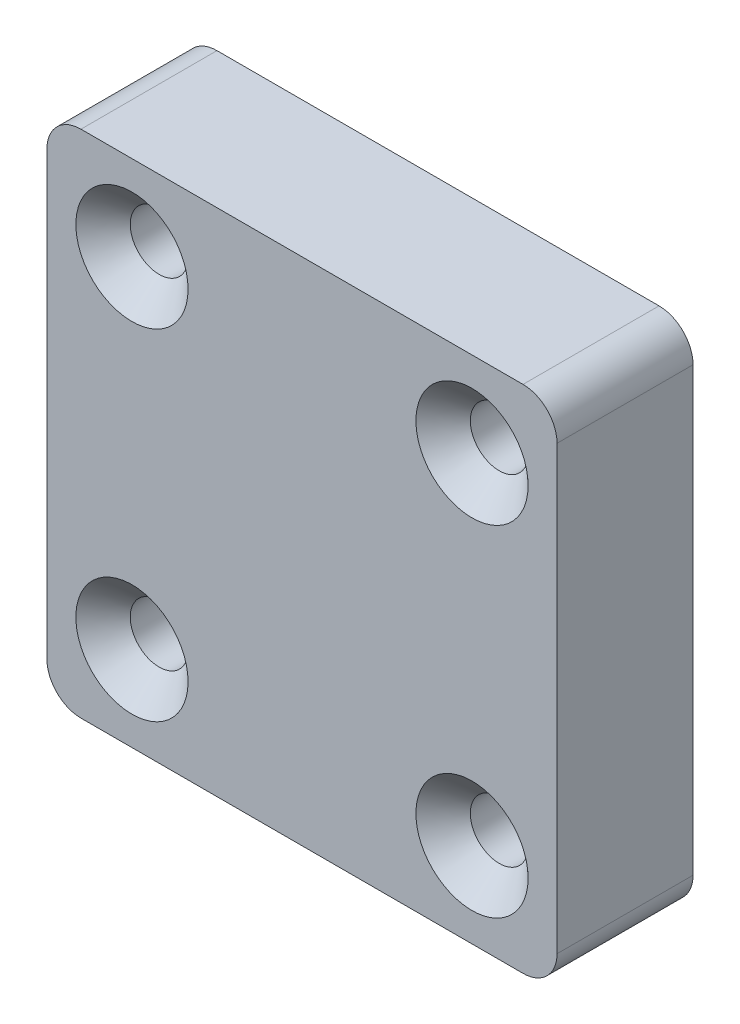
ISO-10303-21;
HEADER;
FILE_DESCRIPTION(('STEP AP214'),'2;1');
FILE_NAME('part.step','',(''),(''),'','','');
FILE_SCHEMA(('AUTOMOTIVE_DESIGN { 1 0 10303 214 1 1 1 1 }'));
ENDSEC;
DATA;
#1=APPLICATION_CONTEXT('core data for automotive mechanical design processes');
#2=APPLICATION_PROTOCOL_DEFINITION('international standard','automotive_design',2000,#1);
#3=PRODUCT_CONTEXT('',#1,'mechanical');
#4=PRODUCT('Part','Part','',(#3));
#5=PRODUCT_RELATED_PRODUCT_CATEGORY('part','',(#4));
#6=PRODUCT_DEFINITION_FORMATION('','',#4);
#7=PRODUCT_DEFINITION_CONTEXT('part definition',#1,'design');
#8=PRODUCT_DEFINITION('design','',#6,#7);
#9=PRODUCT_DEFINITION_SHAPE('','',#8);
#10=(LENGTH_UNIT() NAMED_UNIT(*) SI_UNIT(.MILLI.,.METRE.));
#11=(NAMED_UNIT(*) PLANE_ANGLE_UNIT() SI_UNIT($,.RADIAN.));
#12=(NAMED_UNIT(*) SI_UNIT($,.STERADIAN.) SOLID_ANGLE_UNIT());
#13=UNCERTAINTY_MEASURE_WITH_UNIT(LENGTH_MEASURE(1.E-05),#10,'distance_accuracy_value','');
#14=(GEOMETRIC_REPRESENTATION_CONTEXT(3) GLOBAL_UNCERTAINTY_ASSIGNED_CONTEXT((#13)) GLOBAL_UNIT_ASSIGNED_CONTEXT((#10,
#11,#12)) REPRESENTATION_CONTEXT('',''));
#15=CARTESIAN_POINT('',(0.,0.,0.));
#16=DIRECTION('',(0.,0.,1.));
#17=DIRECTION('',(1.,0.,0.));
#18=AXIS2_PLACEMENT_3D('',#15,#16,#17);
#19=CARTESIAN_POINT('',(15.,15.,10.));
#20=DIRECTION('',(-1.,0.,0.));
#21=DIRECTION('',(0.,-1.,0.));
#22=AXIS2_PLACEMENT_3D('',#19,#20,#21);
#23=PLANE('',#22);
#24=DIRECTION('',(0.,-1.,0.));
#25=VECTOR('',#24,1.);
#26=CARTESIAN_POINT('',(15.,13.,2.));
#27=LINE('',#26,#25);
#28=CARTESIAN_POINT('',(15.,13.,2.));
#29=VERTEX_POINT('',#28);
#30=CARTESIAN_POINT('',(15.,-13.,2.));
#31=VERTEX_POINT('',#30);
#32=EDGE_CURVE('E115',#29,#31,#27,.T.);
#33=ORIENTED_EDGE('',*,*,#32,.F.);
#34=DIRECTION('',(0.,0.,-1.));
#35=VECTOR('',#34,1.);
#36=CARTESIAN_POINT('',(15.,13.,10.));
#37=LINE('',#36,#35);
#38=CARTESIAN_POINT('',(15.,13.,10.));
#39=VERTEX_POINT('',#38);
#40=EDGE_CURVE('E165',#29,#39,#37,.F.);
#41=ORIENTED_EDGE('',*,*,#40,.T.);
#42=DIRECTION('',(0.,1.,0.));
#43=VECTOR('',#42,1.);
#44=CARTESIAN_POINT('',(15.,15.,10.));
#45=LINE('',#44,#43);
#46=CARTESIAN_POINT('',(15.,-13.,10.));
#47=VERTEX_POINT('',#46);
#48=EDGE_CURVE('E223',#47,#39,#45,.T.);
#49=ORIENTED_EDGE('',*,*,#48,.F.);
#50=DIRECTION('',(0.,0.,-1.));
#51=VECTOR('',#50,1.);
#52=CARTESIAN_POINT('',(15.,-13.,10.));
#53=LINE('',#52,#51);
#54=EDGE_CURVE('E168',#47,#31,#53,.T.);
#55=ORIENTED_EDGE('',*,*,#54,.T.);
#56=EDGE_LOOP('',(#33,#41,#49,#55));
#57=FACE_BOUND('',#56,.T.);
#58=ADVANCED_FACE('F43',(#57),#23,.F.);
#59=CARTESIAN_POINT('',(-15.,15.,10.));
#60=DIRECTION('',(0.,-1.,0.));
#61=DIRECTION('',(0.,0.,-1.));
#62=AXIS2_PLACEMENT_3D('',#59,#60,#61);
#63=PLANE('',#62);
#64=DIRECTION('',(1.,0.,0.));
#65=VECTOR('',#64,1.);
#66=CARTESIAN_POINT('',(-13.,15.,2.));
#67=LINE('',#66,#65);
#68=CARTESIAN_POINT('',(-13.,15.,2.));
#69=VERTEX_POINT('',#68);
#70=CARTESIAN_POINT('',(13.,15.,2.));
#71=VERTEX_POINT('',#70);
#72=EDGE_CURVE('E248',#69,#71,#67,.T.);
#73=ORIENTED_EDGE('',*,*,#72,.F.);
#74=DIRECTION('',(0.,0.,-1.));
#75=VECTOR('',#74,1.);
#76=CARTESIAN_POINT('',(-13.,15.,10.));
#77=LINE('',#76,#75);
#78=CARTESIAN_POINT('',(-13.,15.,10.));
#79=VERTEX_POINT('',#78);
#80=EDGE_CURVE('E52',#69,#79,#77,.F.);
#81=ORIENTED_EDGE('',*,*,#80,.T.);
#82=DIRECTION('',(-1.,0.,0.));
#83=VECTOR('',#82,1.);
#84=CARTESIAN_POINT('',(-15.,15.,10.));
#85=LINE('',#84,#83);
#86=CARTESIAN_POINT('',(13.,15.,10.));
#87=VERTEX_POINT('',#86);
#88=EDGE_CURVE('E185',#87,#79,#85,.T.);
#89=ORIENTED_EDGE('',*,*,#88,.F.);
#90=DIRECTION('',(0.,0.,-1.));
#91=VECTOR('',#90,1.);
#92=CARTESIAN_POINT('',(13.,15.,10.));
#93=LINE('',#92,#91);
#94=EDGE_CURVE('E11',#87,#71,#93,.T.);
#95=ORIENTED_EDGE('',*,*,#94,.T.);
#96=EDGE_LOOP('',(#73,#81,#89,#95));
#97=FACE_BOUND('',#96,.T.);
#98=ADVANCED_FACE('F279',(#97),#63,.F.);
#99=CARTESIAN_POINT('',(-15.,15.,10.));
#100=DIRECTION('',(1.,0.,0.));
#101=DIRECTION('',(0.,1.,0.));
#102=AXIS2_PLACEMENT_3D('',#99,#100,#101);
#103=PLANE('',#102);
#104=DIRECTION('',(0.,1.,0.));
#105=VECTOR('',#104,1.);
#106=CARTESIAN_POINT('',(-15.,-13.,2.));
#107=LINE('',#106,#105);
#108=CARTESIAN_POINT('',(-15.,-13.,2.));
#109=VERTEX_POINT('',#108);
#110=CARTESIAN_POINT('',(-15.,13.,2.));
#111=VERTEX_POINT('',#110);
#112=EDGE_CURVE('E59',#109,#111,#107,.T.);
#113=ORIENTED_EDGE('',*,*,#112,.F.);
#114=DIRECTION('',(0.,0.,-1.));
#115=VECTOR('',#114,1.);
#116=CARTESIAN_POINT('',(-15.,-13.,10.));
#117=LINE('',#116,#115);
#118=CARTESIAN_POINT('',(-15.,-13.,10.));
#119=VERTEX_POINT('',#118);
#120=EDGE_CURVE('E152',#109,#119,#117,.F.);
#121=ORIENTED_EDGE('',*,*,#120,.T.);
#122=DIRECTION('',(0.,-1.,0.));
#123=VECTOR('',#122,1.);
#124=CARTESIAN_POINT('',(-15.,15.,10.));
#125=LINE('',#124,#123);
#126=CARTESIAN_POINT('',(-15.,13.,10.));
#127=VERTEX_POINT('',#126);
#128=EDGE_CURVE('E145',#127,#119,#125,.T.);
#129=ORIENTED_EDGE('',*,*,#128,.F.);
#130=DIRECTION('',(0.,0.,-1.));
#131=VECTOR('',#130,1.);
#132=CARTESIAN_POINT('',(-15.,13.,10.));
#133=LINE('',#132,#131);
#134=EDGE_CURVE('E142',#127,#111,#133,.T.);
#135=ORIENTED_EDGE('',*,*,#134,.T.);
#136=EDGE_LOOP('',(#113,#121,#129,#135));
#137=FACE_BOUND('',#136,.T.);
#138=ADVANCED_FACE('F237',(#137),#103,.F.);
#139=CARTESIAN_POINT('',(-15.,-15.,10.));
#140=DIRECTION('',(0.,1.,0.));
#141=DIRECTION('',(0.,0.,1.));
#142=AXIS2_PLACEMENT_3D('',#139,#140,#141);
#143=PLANE('',#142);
#144=DIRECTION('',(-1.,0.,0.));
#145=VECTOR('',#144,1.);
#146=CARTESIAN_POINT('',(13.,-15.,2.));
#147=LINE('',#146,#145);
#148=CARTESIAN_POINT('',(13.,-15.,2.));
#149=VERTEX_POINT('',#148);
#150=CARTESIAN_POINT('',(-13.,-15.,2.));
#151=VERTEX_POINT('',#150);
#152=EDGE_CURVE('E112',#149,#151,#147,.T.);
#153=ORIENTED_EDGE('',*,*,#152,.F.);
#154=DIRECTION('',(0.,0.,-1.));
#155=VECTOR('',#154,1.);
#156=CARTESIAN_POINT('',(13.,-15.,10.));
#157=LINE('',#156,#155);
#158=CARTESIAN_POINT('',(13.,-15.,10.));
#159=VERTEX_POINT('',#158);
#160=EDGE_CURVE('E126',#149,#159,#157,.F.);
#161=ORIENTED_EDGE('',*,*,#160,.T.);
#162=DIRECTION('',(1.,0.,0.));
#163=VECTOR('',#162,1.);
#164=CARTESIAN_POINT('',(-15.,-15.,10.));
#165=LINE('',#164,#163);
#166=CARTESIAN_POINT('',(-13.,-15.,10.));
#167=VERTEX_POINT('',#166);
#168=EDGE_CURVE('E137',#167,#159,#165,.T.);
#169=ORIENTED_EDGE('',*,*,#168,.F.);
#170=DIRECTION('',(0.,0.,-1.));
#171=VECTOR('',#170,1.);
#172=CARTESIAN_POINT('',(-13.,-15.,10.));
#173=LINE('',#172,#171);
#174=EDGE_CURVE('E129',#167,#151,#173,.T.);
#175=ORIENTED_EDGE('',*,*,#174,.T.);
#176=EDGE_LOOP('',(#153,#161,#169,#175));
#177=FACE_BOUND('',#176,.T.);
#178=ADVANCED_FACE('F124',(#177),#143,.F.);
#179=CARTESIAN_POINT('',(10.,-10.,10.));
#180=DIRECTION('',(0.,0.,1.));
#181=DIRECTION('',(1.,0.,0.));
#182=AXIS2_PLACEMENT_3D('',#179,#180,#181);
#183=CYLINDRICAL_SURFACE('',#182,1.7);
#184=CARTESIAN_POINT('',(10.,-10.,8.4));
#185=DIRECTION('',(0.,0.,1.));
#186=DIRECTION('',(1.,0.,0.));
#187=AXIS2_PLACEMENT_3D('',#184,#185,#186);
#188=CIRCLE('',#187,1.7);
#189=CARTESIAN_POINT('',(11.7,-10.,8.4));
#190=VERTEX_POINT('',#189);
#191=EDGE_CURVE('E190',#190,#190,#188,.T.);
#192=ORIENTED_EDGE('',*,*,#191,.T.);
#193=EDGE_LOOP('',(#192));
#194=FACE_BOUND('',#193,.T.);
#195=CARTESIAN_POINT('',(10.,-10.,2.));
#196=DIRECTION('',(0.,0.,-1.));
#197=DIRECTION('',(-1.,0.,0.));
#198=AXIS2_PLACEMENT_3D('',#195,#196,#197);
#199=CIRCLE('',#198,1.7);
#200=CARTESIAN_POINT('',(8.3,-10.,2.));
#201=VERTEX_POINT('',#200);
#202=EDGE_CURVE('E181',#201,#201,#199,.F.);
#203=ORIENTED_EDGE('',*,*,#202,.F.);
#204=EDGE_LOOP('',(#203));
#205=FACE_BOUND('',#204,.T.);
#206=ADVANCED_FACE('F273',(#194,#205),#183,.F.);
#207=CARTESIAN_POINT('',(-10.,-10.,10.));
#208=DIRECTION('',(0.,0.,1.));
#209=DIRECTION('',(1.,0.,0.));
#210=AXIS2_PLACEMENT_3D('',#207,#208,#209);
#211=CYLINDRICAL_SURFACE('',#210,1.7);
#212=CARTESIAN_POINT('',(-10.,-10.,8.4));
#213=DIRECTION('',(0.,0.,1.));
#214=DIRECTION('',(1.,0.,0.));
#215=AXIS2_PLACEMENT_3D('',#212,#213,#214);
#216=CIRCLE('',#215,1.7);
#217=CARTESIAN_POINT('',(-8.3,-10.,8.4));
#218=VERTEX_POINT('',#217);
#219=EDGE_CURVE('E191',#218,#218,#216,.T.);
#220=ORIENTED_EDGE('',*,*,#219,.T.);
#221=EDGE_LOOP('',(#220));
#222=FACE_BOUND('',#221,.T.);
#223=CARTESIAN_POINT('',(-10.,-10.,2.));
#224=DIRECTION('',(0.,0.,-1.));
#225=DIRECTION('',(-1.,0.,0.));
#226=AXIS2_PLACEMENT_3D('',#223,#224,#225);
#227=CIRCLE('',#226,1.7);
#228=CARTESIAN_POINT('',(-11.7,-10.,2.));
#229=VERTEX_POINT('',#228);
#230=EDGE_CURVE('E194',#229,#229,#227,.F.);
#231=ORIENTED_EDGE('',*,*,#230,.F.);
#232=EDGE_LOOP('',(#231));
#233=FACE_BOUND('',#232,.T.);
#234=ADVANCED_FACE('F265',(#222,#233),#211,.F.);
#235=CARTESIAN_POINT('',(10.,10.,10.));
#236=DIRECTION('',(0.,0.,1.));
#237=DIRECTION('',(1.,0.,0.));
#238=AXIS2_PLACEMENT_3D('',#235,#236,#237);
#239=CYLINDRICAL_SURFACE('',#238,1.7);
#240=CARTESIAN_POINT('',(10.,10.,8.4));
#241=DIRECTION('',(0.,0.,1.));
#242=DIRECTION('',(1.,0.,0.));
#243=AXIS2_PLACEMENT_3D('',#240,#241,#242);
#244=CIRCLE('',#243,1.7);
#245=CARTESIAN_POINT('',(11.7,10.,8.4));
#246=VERTEX_POINT('',#245);
#247=EDGE_CURVE('E209',#246,#246,#244,.T.);
#248=ORIENTED_EDGE('',*,*,#247,.T.);
#249=EDGE_LOOP('',(#248));
#250=FACE_BOUND('',#249,.T.);
#251=CARTESIAN_POINT('',(10.,10.,2.));
#252=DIRECTION('',(0.,0.,-1.));
#253=DIRECTION('',(-1.,0.,0.));
#254=AXIS2_PLACEMENT_3D('',#251,#252,#253);
#255=CIRCLE('',#254,1.7);
#256=CARTESIAN_POINT('',(8.3,10.,2.));
#257=VERTEX_POINT('',#256);
#258=EDGE_CURVE('E199',#257,#257,#255,.F.);
#259=ORIENTED_EDGE('',*,*,#258,.F.);
#260=EDGE_LOOP('',(#259));
#261=FACE_BOUND('',#260,.T.);
#262=ADVANCED_FACE('F262',(#250,#261),#239,.F.);
#263=CARTESIAN_POINT('',(-10.,10.,10.));
#264=DIRECTION('',(0.,0.,1.));
#265=DIRECTION('',(1.,0.,0.));
#266=AXIS2_PLACEMENT_3D('',#263,#264,#265);
#267=CYLINDRICAL_SURFACE('',#266,1.7);
#268=CARTESIAN_POINT('',(-10.,10.,8.4));
#269=DIRECTION('',(0.,0.,1.));
#270=DIRECTION('',(1.,0.,0.));
#271=AXIS2_PLACEMENT_3D('',#268,#269,#270);
#272=CIRCLE('',#271,1.7);
#273=CARTESIAN_POINT('',(-8.3,10.,8.4));
#274=VERTEX_POINT('',#273);
#275=EDGE_CURVE('E180',#274,#274,#272,.T.);
#276=ORIENTED_EDGE('',*,*,#275,.T.);
#277=EDGE_LOOP('',(#276));
#278=FACE_BOUND('',#277,.T.);
#279=CARTESIAN_POINT('',(-10.,10.,2.));
#280=DIRECTION('',(0.,0.,-1.));
#281=DIRECTION('',(-1.,0.,0.));
#282=AXIS2_PLACEMENT_3D('',#279,#280,#281);
#283=CIRCLE('',#282,1.7);
#284=CARTESIAN_POINT('',(-11.7,10.,2.));
#285=VERTEX_POINT('',#284);
#286=EDGE_CURVE('E172',#285,#285,#283,.F.);
#287=ORIENTED_EDGE('',*,*,#286,.F.);
#288=EDGE_LOOP('',(#287));
#289=FACE_BOUND('',#288,.T.);
#290=ADVANCED_FACE('F264',(#278,#289),#267,.F.);
#291=CARTESIAN_POINT('',(-13.,-13.,10.));
#292=DIRECTION('',(0.,0.,-1.));
#293=DIRECTION('',(-1.,0.,0.));
#294=AXIS2_PLACEMENT_3D('',#291,#292,#293);
#295=CYLINDRICAL_SURFACE('',#294,2.);
#296=ORIENTED_EDGE('',*,*,#120,.F.);
#297=CARTESIAN_POINT('',(-13.,-13.,2.));
#298=DIRECTION('',(0.,0.,-1.));
#299=DIRECTION('',(-1.,0.,0.));
#300=AXIS2_PLACEMENT_3D('',#297,#298,#299);
#301=CIRCLE('',#300,2.);
#302=EDGE_CURVE('E131',#151,#109,#301,.T.);
#303=ORIENTED_EDGE('',*,*,#302,.F.);
#304=ORIENTED_EDGE('',*,*,#174,.F.);
#305=CARTESIAN_POINT('',(-13.,-13.,10.));
#306=DIRECTION('',(0.,0.,1.));
#307=DIRECTION('',(1.,0.,0.));
#308=AXIS2_PLACEMENT_3D('',#305,#306,#307);
#309=CIRCLE('',#308,2.);
#310=EDGE_CURVE('E162',#119,#167,#309,.T.);
#311=ORIENTED_EDGE('',*,*,#310,.F.);
#312=EDGE_LOOP('',(#296,#303,#304,#311));
#313=FACE_BOUND('',#312,.T.);
#314=ADVANCED_FACE('F241',(#313),#295,.T.);
#315=CARTESIAN_POINT('',(13.,-13.,10.));
#316=DIRECTION('',(0.,0.,-1.));
#317=DIRECTION('',(-1.,0.,0.));
#318=AXIS2_PLACEMENT_3D('',#315,#316,#317);
#319=CYLINDRICAL_SURFACE('',#318,2.);
#320=ORIENTED_EDGE('',*,*,#160,.F.);
#321=CARTESIAN_POINT('',(13.,-13.,2.));
#322=DIRECTION('',(0.,0.,-1.));
#323=DIRECTION('',(-1.,0.,0.));
#324=AXIS2_PLACEMENT_3D('',#321,#322,#323);
#325=CIRCLE('',#324,2.);
#326=EDGE_CURVE('E108',#31,#149,#325,.T.);
#327=ORIENTED_EDGE('',*,*,#326,.F.);
#328=ORIENTED_EDGE('',*,*,#54,.F.);
#329=CARTESIAN_POINT('',(13.,-13.,10.));
#330=DIRECTION('',(0.,0.,1.));
#331=DIRECTION('',(1.,0.,0.));
#332=AXIS2_PLACEMENT_3D('',#329,#330,#331);
#333=CIRCLE('',#332,2.);
#334=EDGE_CURVE('E135',#159,#47,#333,.T.);
#335=ORIENTED_EDGE('',*,*,#334,.F.);
#336=EDGE_LOOP('',(#320,#327,#328,#335));
#337=FACE_BOUND('',#336,.T.);
#338=ADVANCED_FACE('F134',(#337),#319,.T.);
#339=CARTESIAN_POINT('',(13.,13.,10.));
#340=DIRECTION('',(0.,0.,-1.));
#341=DIRECTION('',(-1.,0.,0.));
#342=AXIS2_PLACEMENT_3D('',#339,#340,#341);
#343=CYLINDRICAL_SURFACE('',#342,2.);
#344=ORIENTED_EDGE('',*,*,#40,.F.);
#345=CARTESIAN_POINT('',(13.,13.,2.));
#346=DIRECTION('',(0.,0.,-1.));
#347=DIRECTION('',(-1.,0.,0.));
#348=AXIS2_PLACEMENT_3D('',#345,#346,#347);
#349=CIRCLE('',#348,2.);
#350=EDGE_CURVE('E250',#71,#29,#349,.T.);
#351=ORIENTED_EDGE('',*,*,#350,.F.);
#352=ORIENTED_EDGE('',*,*,#94,.F.);
#353=CARTESIAN_POINT('',(13.,13.,10.));
#354=DIRECTION('',(0.,0.,1.));
#355=DIRECTION('',(1.,0.,0.));
#356=AXIS2_PLACEMENT_3D('',#353,#354,#355);
#357=CIRCLE('',#356,2.);
#358=EDGE_CURVE('E157',#39,#87,#357,.T.);
#359=ORIENTED_EDGE('',*,*,#358,.F.);
#360=EDGE_LOOP('',(#344,#351,#352,#359));
#361=FACE_BOUND('',#360,.T.);
#362=ADVANCED_FACE('F290',(#361),#343,.T.);
#363=CARTESIAN_POINT('',(-13.,13.,10.));
#364=DIRECTION('',(0.,0.,-1.));
#365=DIRECTION('',(-1.,0.,0.));
#366=AXIS2_PLACEMENT_3D('',#363,#364,#365);
#367=CYLINDRICAL_SURFACE('',#366,2.);
#368=ORIENTED_EDGE('',*,*,#80,.F.);
#369=CARTESIAN_POINT('',(-13.,13.,2.));
#370=DIRECTION('',(0.,0.,-1.));
#371=DIRECTION('',(-1.,0.,0.));
#372=AXIS2_PLACEMENT_3D('',#369,#370,#371);
#373=CIRCLE('',#372,2.);
#374=EDGE_CURVE('E176',#111,#69,#373,.T.);
#375=ORIENTED_EDGE('',*,*,#374,.F.);
#376=ORIENTED_EDGE('',*,*,#134,.F.);
#377=CARTESIAN_POINT('',(-13.,13.,10.));
#378=DIRECTION('',(0.,0.,1.));
#379=DIRECTION('',(1.,0.,0.));
#380=AXIS2_PLACEMENT_3D('',#377,#378,#379);
#381=CIRCLE('',#380,2.);
#382=EDGE_CURVE('E154',#79,#127,#381,.T.);
#383=ORIENTED_EDGE('',*,*,#382,.F.);
#384=EDGE_LOOP('',(#368,#375,#376,#383));
#385=FACE_BOUND('',#384,.T.);
#386=ADVANCED_FACE('F45',(#385),#367,.T.);
#387=CARTESIAN_POINT('',(0.,0.,10.));
#388=DIRECTION('',(0.,0.,1.));
#389=DIRECTION('',(1.,0.,0.));
#390=AXIS2_PLACEMENT_3D('',#387,#388,#389);
#391=PLANE('',#390);
#392=CARTESIAN_POINT('',(-10.,10.,10.));
#393=DIRECTION('',(0.,0.,1.));
#394=DIRECTION('',(1.,0.,0.));
#395=AXIS2_PLACEMENT_3D('',#392,#393,#394);
#396=CIRCLE('',#395,3.3);
#397=CARTESIAN_POINT('',(-6.7,10.,10.));
#398=VERTEX_POINT('',#397);
#399=EDGE_CURVE('E178',#398,#398,#396,.T.);
#400=ORIENTED_EDGE('',*,*,#399,.F.);
#401=EDGE_LOOP('',(#400));
#402=FACE_BOUND('',#401,.T.);
#403=CARTESIAN_POINT('',(10.,10.,10.));
#404=DIRECTION('',(0.,0.,1.));
#405=DIRECTION('',(1.,0.,0.));
#406=AXIS2_PLACEMENT_3D('',#403,#404,#405);
#407=CIRCLE('',#406,3.3);
#408=CARTESIAN_POINT('',(13.3,10.,10.));
#409=VERTEX_POINT('',#408);
#410=EDGE_CURVE('E206',#409,#409,#407,.T.);
#411=ORIENTED_EDGE('',*,*,#410,.F.);
#412=EDGE_LOOP('',(#411));
#413=FACE_BOUND('',#412,.T.);
#414=CARTESIAN_POINT('',(-10.,-10.,10.));
#415=DIRECTION('',(0.,0.,1.));
#416=DIRECTION('',(1.,0.,0.));
#417=AXIS2_PLACEMENT_3D('',#414,#415,#416);
#418=CIRCLE('',#417,3.3);
#419=CARTESIAN_POINT('',(-6.7,-10.,10.));
#420=VERTEX_POINT('',#419);
#421=EDGE_CURVE('E213',#420,#420,#418,.T.);
#422=ORIENTED_EDGE('',*,*,#421,.F.);
#423=EDGE_LOOP('',(#422));
#424=FACE_BOUND('',#423,.T.);
#425=CARTESIAN_POINT('',(10.,-10.,10.));
#426=DIRECTION('',(0.,0.,1.));
#427=DIRECTION('',(1.,0.,0.));
#428=AXIS2_PLACEMENT_3D('',#425,#426,#427);
#429=CIRCLE('',#428,3.3);
#430=CARTESIAN_POINT('',(13.3,-10.,10.));
#431=VERTEX_POINT('',#430);
#432=EDGE_CURVE('E187',#431,#431,#429,.T.);
#433=ORIENTED_EDGE('',*,*,#432,.F.);
#434=EDGE_LOOP('',(#433));
#435=FACE_BOUND('',#434,.T.);
#436=ORIENTED_EDGE('',*,*,#128,.T.);
#437=ORIENTED_EDGE('',*,*,#310,.T.);
#438=ORIENTED_EDGE('',*,*,#168,.T.);
#439=ORIENTED_EDGE('',*,*,#334,.T.);
#440=ORIENTED_EDGE('',*,*,#48,.T.);
#441=ORIENTED_EDGE('',*,*,#358,.T.);
#442=ORIENTED_EDGE('',*,*,#88,.T.);
#443=ORIENTED_EDGE('',*,*,#382,.T.);
#444=EDGE_LOOP('',(#436,#437,#438,#439,#440,#441,#442,#443));
#445=FACE_BOUND('',#444,.T.);
#446=ADVANCED_FACE('F230',(#402,#413,#424,#435,#445),#391,.T.);
#447=CARTESIAN_POINT('',(10.,-10.,10.));
#448=DIRECTION('',(0.,0.,1.));
#449=DIRECTION('',(1.,0.,0.));
#450=AXIS2_PLACEMENT_3D('',#447,#448,#449);
#451=CONICAL_SURFACE('',#450,3.3,0.785398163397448);
#452=ORIENTED_EDGE('',*,*,#191,.F.);
#453=EDGE_LOOP('',(#452));
#454=FACE_BOUND('',#453,.T.);
#455=ORIENTED_EDGE('',*,*,#432,.T.);
#456=EDGE_LOOP('',(#455));
#457=FACE_BOUND('',#456,.T.);
#458=ADVANCED_FACE('F300',(#454,#457),#451,.F.);
#459=CARTESIAN_POINT('',(-10.,-10.,10.));
#460=DIRECTION('',(0.,0.,1.));
#461=DIRECTION('',(1.,0.,0.));
#462=AXIS2_PLACEMENT_3D('',#459,#460,#461);
#463=CONICAL_SURFACE('',#462,3.3,0.785398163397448);
#464=ORIENTED_EDGE('',*,*,#219,.F.);
#465=EDGE_LOOP('',(#464));
#466=FACE_BOUND('',#465,.T.);
#467=ORIENTED_EDGE('',*,*,#421,.T.);
#468=EDGE_LOOP('',(#467));
#469=FACE_BOUND('',#468,.T.);
#470=ADVANCED_FACE('F305',(#466,#469),#463,.F.);
#471=CARTESIAN_POINT('',(10.,10.,10.));
#472=DIRECTION('',(0.,0.,1.));
#473=DIRECTION('',(1.,0.,0.));
#474=AXIS2_PLACEMENT_3D('',#471,#472,#473);
#475=CONICAL_SURFACE('',#474,3.3,0.785398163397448);
#476=ORIENTED_EDGE('',*,*,#247,.F.);
#477=EDGE_LOOP('',(#476));
#478=FACE_BOUND('',#477,.T.);
#479=ORIENTED_EDGE('',*,*,#410,.T.);
#480=EDGE_LOOP('',(#479));
#481=FACE_BOUND('',#480,.T.);
#482=ADVANCED_FACE('F375',(#478,#481),#475,.F.);
#483=CARTESIAN_POINT('',(-10.,10.,10.));
#484=DIRECTION('',(0.,0.,1.));
#485=DIRECTION('',(1.,0.,0.));
#486=AXIS2_PLACEMENT_3D('',#483,#484,#485);
#487=CONICAL_SURFACE('',#486,3.3,0.785398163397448);
#488=ORIENTED_EDGE('',*,*,#275,.F.);
#489=EDGE_LOOP('',(#488));
#490=FACE_BOUND('',#489,.T.);
#491=ORIENTED_EDGE('',*,*,#399,.T.);
#492=EDGE_LOOP('',(#491));
#493=FACE_BOUND('',#492,.T.);
#494=ADVANCED_FACE('F364',(#490,#493),#487,.F.);
#495=CARTESIAN_POINT('',(13.,-13.,2.));
#496=DIRECTION('',(0.,0.,-1.));
#497=DIRECTION('',(-1.,0.,0.));
#498=AXIS2_PLACEMENT_3D('',#495,#496,#497);
#499=PLANE('',#498);
#500=ORIENTED_EDGE('',*,*,#326,.T.);
#501=ORIENTED_EDGE('',*,*,#152,.T.);
#502=ORIENTED_EDGE('',*,*,#302,.T.);
#503=ORIENTED_EDGE('',*,*,#112,.T.);
#504=ORIENTED_EDGE('',*,*,#374,.T.);
#505=ORIENTED_EDGE('',*,*,#72,.T.);
#506=ORIENTED_EDGE('',*,*,#350,.T.);
#507=ORIENTED_EDGE('',*,*,#32,.T.);
#508=EDGE_LOOP('',(#500,#501,#502,#503,#504,#505,#506,#507));
#509=FACE_BOUND('',#508,.T.);
#510=ORIENTED_EDGE('',*,*,#286,.T.);
#511=EDGE_LOOP('',(#510));
#512=FACE_BOUND('',#511,.T.);
#513=ORIENTED_EDGE('',*,*,#258,.T.);
#514=EDGE_LOOP('',(#513));
#515=FACE_BOUND('',#514,.T.);
#516=ORIENTED_EDGE('',*,*,#230,.T.);
#517=EDGE_LOOP('',(#516));
#518=FACE_BOUND('',#517,.T.);
#519=ORIENTED_EDGE('',*,*,#202,.T.);
#520=EDGE_LOOP('',(#519));
#521=FACE_BOUND('',#520,.T.);
#522=ADVANCED_FACE('F110',(#509,#512,#515,#518,#521),#499,.T.);
#523=CLOSED_SHELL('',(#58,#98,#138,#178,#206,#234,#262,#290,#314,#338,#362,#386,#446,#458,#470,
#482,#494,#522));
#524=MANIFOLD_SOLID_BREP('B2',#523);
#525=ADVANCED_BREP_SHAPE_REPRESENTATION('',(#18,#524),#14);
#526=SHAPE_DEFINITION_REPRESENTATION(#9,#525);
ENDSEC;
END-ISO-10303-21;
